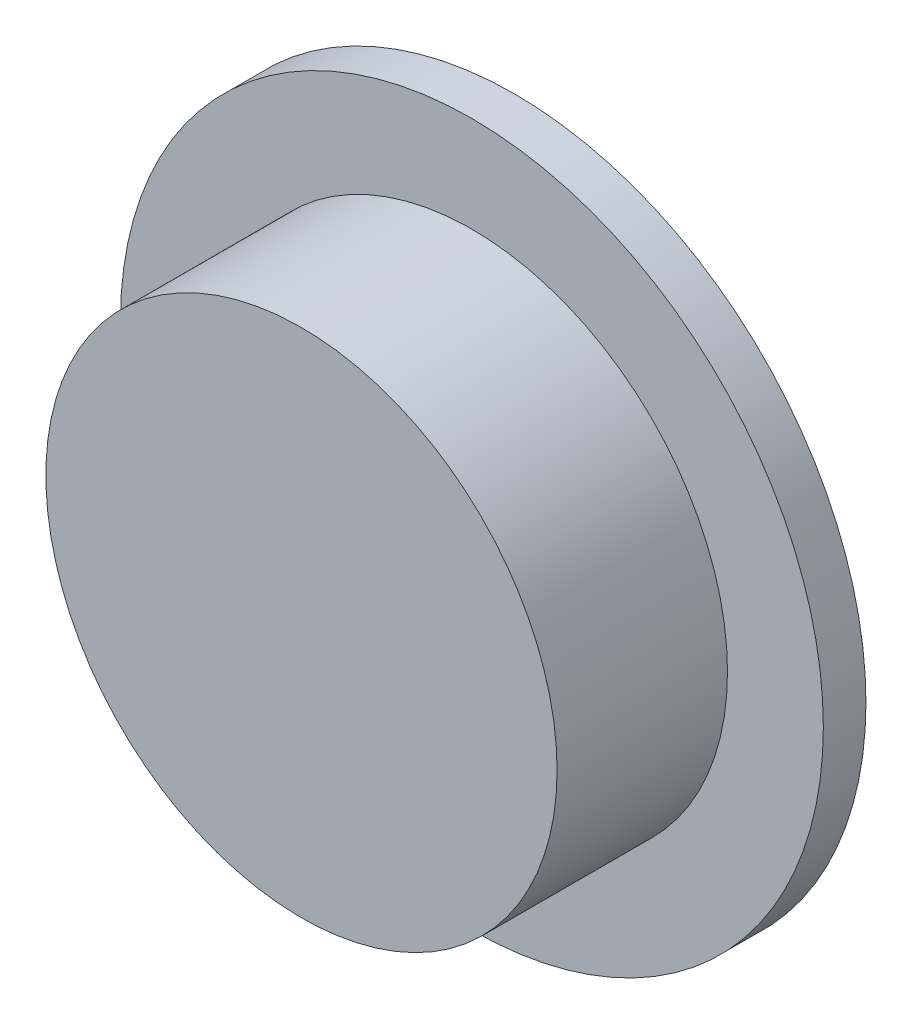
ISO-10303-21;
HEADER;
FILE_DESCRIPTION(('STEP AP214'),'2;1');
FILE_NAME('part.step','',(''),(''),'','','');
FILE_SCHEMA(('AUTOMOTIVE_DESIGN { 1 0 10303 214 1 1 1 1 }'));
ENDSEC;
DATA;
#1=APPLICATION_CONTEXT('core data for automotive mechanical design processes');
#2=APPLICATION_PROTOCOL_DEFINITION('international standard','automotive_design',2000,#1);
#3=PRODUCT_CONTEXT('',#1,'mechanical');
#4=PRODUCT('Part','Part','',(#3));
#5=PRODUCT_RELATED_PRODUCT_CATEGORY('part','',(#4));
#6=PRODUCT_DEFINITION_FORMATION('','',#4);
#7=PRODUCT_DEFINITION_CONTEXT('part definition',#1,'design');
#8=PRODUCT_DEFINITION('design','',#6,#7);
#9=PRODUCT_DEFINITION_SHAPE('','',#8);
#10=(LENGTH_UNIT() NAMED_UNIT(*) SI_UNIT(.MILLI.,.METRE.));
#11=(NAMED_UNIT(*) PLANE_ANGLE_UNIT() SI_UNIT($,.RADIAN.));
#12=(NAMED_UNIT(*) SI_UNIT($,.STERADIAN.) SOLID_ANGLE_UNIT());
#13=UNCERTAINTY_MEASURE_WITH_UNIT(LENGTH_MEASURE(1.E-05),#10,'distance_accuracy_value','');
#14=(GEOMETRIC_REPRESENTATION_CONTEXT(3) GLOBAL_UNCERTAINTY_ASSIGNED_CONTEXT((#13)) GLOBAL_UNIT_ASSIGNED_CONTEXT((#10,
#11,#12)) REPRESENTATION_CONTEXT('',''));
#15=CARTESIAN_POINT('',(0.,0.,0.));
#16=DIRECTION('',(0.,0.,1.));
#17=DIRECTION('',(1.,0.,0.));
#18=AXIS2_PLACEMENT_3D('',#15,#16,#17);
#19=CARTESIAN_POINT('',(0.,0.,2.));
#20=DIRECTION('',(0.,0.,-1.));
#21=DIRECTION('',(-1.,0.,0.));
#22=AXIS2_PLACEMENT_3D('',#19,#20,#21);
#23=CYLINDRICAL_SURFACE('',#22,16.5);
#24=CARTESIAN_POINT('',(0.,0.,2.));
#25=DIRECTION('',(0.,0.,1.));
#26=DIRECTION('',(1.,0.,0.));
#27=AXIS2_PLACEMENT_3D('',#24,#25,#26);
#28=CIRCLE('',#27,16.5);
#29=CARTESIAN_POINT('',(16.5,0.,2.));
#30=VERTEX_POINT('',#29);
#31=EDGE_CURVE('E42',#30,#30,#28,.T.);
#32=ORIENTED_EDGE('',*,*,#31,.F.);
#33=EDGE_LOOP('',(#32));
#34=FACE_BOUND('',#33,.T.);
#35=CARTESIAN_POINT('',(0.,0.,0.));
#36=DIRECTION('',(0.,0.,1.));
#37=DIRECTION('',(1.,0.,0.));
#38=AXIS2_PLACEMENT_3D('',#35,#36,#37);
#39=CIRCLE('',#38,16.5);
#40=CARTESIAN_POINT('',(16.5,0.,0.));
#41=VERTEX_POINT('',#40);
#42=EDGE_CURVE('E47',#41,#41,#39,.T.);
#43=ORIENTED_EDGE('',*,*,#42,.T.);
#44=EDGE_LOOP('',(#43));
#45=FACE_BOUND('',#44,.T.);
#46=ADVANCED_FACE('F35',(#34,#45),#23,.T.);
#47=CARTESIAN_POINT('',(0.,0.,2.));
#48=DIRECTION('',(0.,0.,1.));
#49=DIRECTION('',(1.,0.,0.));
#50=AXIS2_PLACEMENT_3D('',#47,#48,#49);
#51=PLANE('',#50);
#52=CARTESIAN_POINT('',(0.,0.,2.));
#53=DIRECTION('',(0.,0.,1.));
#54=DIRECTION('',(1.,0.,0.));
#55=AXIS2_PLACEMENT_3D('',#52,#53,#54);
#56=CIRCLE('',#55,12.);
#57=CARTESIAN_POINT('',(12.,0.,2.));
#58=VERTEX_POINT('',#57);
#59=EDGE_CURVE('E10',#58,#58,#56,.T.);
#60=ORIENTED_EDGE('',*,*,#59,.F.);
#61=EDGE_LOOP('',(#60));
#62=FACE_BOUND('',#61,.T.);
#63=ORIENTED_EDGE('',*,*,#31,.T.);
#64=EDGE_LOOP('',(#63));
#65=FACE_BOUND('',#64,.T.);
#66=ADVANCED_FACE('F93',(#62,#65),#51,.T.);
#67=CARTESIAN_POINT('',(0.,0.,0.));
#68=DIRECTION('',(0.,0.,1.));
#69=DIRECTION('',(1.,0.,0.));
#70=AXIS2_PLACEMENT_3D('',#67,#68,#69);
#71=PLANE('',#70);
#72=CARTESIAN_POINT('',(0.,0.,0.));
#73=DIRECTION('',(0.,0.,1.));
#74=DIRECTION('',(1.,0.,0.));
#75=AXIS2_PLACEMENT_3D('',#72,#73,#74);
#76=CIRCLE('',#75,12.);
#77=CARTESIAN_POINT('',(12.,0.,0.));
#78=VERTEX_POINT('',#77);
#79=EDGE_CURVE('E38',#78,#78,#76,.T.);
#80=ORIENTED_EDGE('',*,*,#79,.T.);
#81=EDGE_LOOP('',(#80));
#82=FACE_BOUND('',#81,.T.);
#83=ORIENTED_EDGE('',*,*,#42,.F.);
#84=EDGE_LOOP('',(#83));
#85=FACE_BOUND('',#84,.T.);
#86=ADVANCED_FACE('F85',(#82,#85),#71,.F.);
#87=CARTESIAN_POINT('',(0.,0.,-2.));
#88=DIRECTION('',(0.,0.,1.));
#89=DIRECTION('',(1.,0.,0.));
#90=AXIS2_PLACEMENT_3D('',#87,#88,#89);
#91=PLANE('',#90);
#92=CARTESIAN_POINT('',(0.,0.,-2.));
#93=DIRECTION('',(0.,0.,-1.));
#94=DIRECTION('',(-1.,0.,0.));
#95=AXIS2_PLACEMENT_3D('',#92,#93,#94);
#96=CIRCLE('',#95,8.00000000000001);
#97=CARTESIAN_POINT('',(-8.00000000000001,0.,-2.));
#98=VERTEX_POINT('',#97);
#99=EDGE_CURVE('E75',#98,#98,#96,.T.);
#100=ORIENTED_EDGE('',*,*,#99,.F.);
#101=EDGE_LOOP('',(#100));
#102=FACE_BOUND('',#101,.T.);
#103=CARTESIAN_POINT('',(0.,0.,-2.));
#104=DIRECTION('',(0.,0.,1.));
#105=DIRECTION('',(1.,0.,0.));
#106=AXIS2_PLACEMENT_3D('',#103,#104,#105);
#107=CIRCLE('',#106,12.);
#108=CARTESIAN_POINT('',(12.,0.,-2.));
#109=VERTEX_POINT('',#108);
#110=EDGE_CURVE('E50',#109,#109,#107,.T.);
#111=ORIENTED_EDGE('',*,*,#110,.F.);
#112=EDGE_LOOP('',(#111));
#113=FACE_BOUND('',#112,.T.);
#114=ADVANCED_FACE('F81',(#102,#113),#91,.F.);
#115=CARTESIAN_POINT('',(0.,0.,-2.));
#116=DIRECTION('',(0.,0.,1.));
#117=DIRECTION('',(1.,0.,0.));
#118=AXIS2_PLACEMENT_3D('',#115,#116,#117);
#119=CYLINDRICAL_SURFACE('',#118,12.);
#120=ORIENTED_EDGE('',*,*,#110,.T.);
#121=EDGE_LOOP('',(#120));
#122=FACE_BOUND('',#121,.T.);
#123=ORIENTED_EDGE('',*,*,#79,.F.);
#124=EDGE_LOOP('',(#123));
#125=FACE_BOUND('',#124,.T.);
#126=ADVANCED_FACE('F84',(#122,#125),#119,.T.);
#127=ORIENTED_EDGE('',*,*,#59,.T.);
#128=EDGE_LOOP('',(#127));
#129=FACE_BOUND('',#128,.T.);
#130=CARTESIAN_POINT('',(0.,0.,10.));
#131=DIRECTION('',(0.,0.,1.));
#132=DIRECTION('',(1.,0.,0.));
#133=AXIS2_PLACEMENT_3D('',#130,#131,#132);
#134=CIRCLE('',#133,12.);
#135=CARTESIAN_POINT('',(12.,0.,10.));
#136=VERTEX_POINT('',#135);
#137=EDGE_CURVE('E59',#136,#136,#134,.T.);
#138=ORIENTED_EDGE('',*,*,#137,.F.);
#139=EDGE_LOOP('',(#138));
#140=FACE_BOUND('',#139,.T.);
#141=ADVANCED_FACE('F91',(#129,#140),#119,.T.);
#142=CARTESIAN_POINT('',(0.,0.,10.));
#143=DIRECTION('',(0.,0.,1.));
#144=DIRECTION('',(1.,0.,0.));
#145=AXIS2_PLACEMENT_3D('',#142,#143,#144);
#146=PLANE('',#145);
#147=ORIENTED_EDGE('',*,*,#137,.T.);
#148=EDGE_LOOP('',(#147));
#149=FACE_BOUND('',#148,.T.);
#150=ADVANCED_FACE('F107',(#149),#146,.T.);
#151=CARTESIAN_POINT('',(0.,0.,4.99988571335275));
#152=DIRECTION('',(0.,0.,1.));
#153=DIRECTION('',(1.,0.,0.));
#154=AXIS2_PLACEMENT_3D('',#151,#152,#153);
#155=PLANE('',#154);
#156=CARTESIAN_POINT('',(0.,0.,4.99988571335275));
#157=DIRECTION('',(0.,0.,-1.));
#158=DIRECTION('',(-1.,0.,0.));
#159=AXIS2_PLACEMENT_3D('',#156,#157,#158);
#160=CIRCLE('',#159,6.00000000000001);
#161=CARTESIAN_POINT('',(-6.00000000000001,0.,4.99988571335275));
#162=VERTEX_POINT('',#161);
#163=EDGE_CURVE('E63',#162,#162,#160,.T.);
#164=ORIENTED_EDGE('',*,*,#163,.T.);
#165=EDGE_LOOP('',(#164));
#166=FACE_BOUND('',#165,.T.);
#167=ADVANCED_FACE('F111',(#166),#155,.F.);
#168=CARTESIAN_POINT('',(0.,0.,-2.));
#169=DIRECTION('',(0.,0.,-1.));
#170=DIRECTION('',(-1.,0.,0.));
#171=AXIS2_PLACEMENT_3D('',#168,#169,#170);
#172=CYLINDRICAL_SURFACE('',#171,6.00000000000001);
#173=ORIENTED_EDGE('',*,*,#163,.F.);
#174=EDGE_LOOP('',(#173));
#175=FACE_BOUND('',#174,.T.);
#176=CARTESIAN_POINT('',(0.,0.,-1.));
#177=DIRECTION('',(0.,0.,-1.));
#178=DIRECTION('',(-1.,0.,0.));
#179=AXIS2_PLACEMENT_3D('',#176,#177,#178);
#180=CIRCLE('',#179,6.00000000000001);
#181=CARTESIAN_POINT('',(-6.00000000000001,0.,-1.));
#182=VERTEX_POINT('',#181);
#183=EDGE_CURVE('E67',#182,#182,#180,.T.);
#184=ORIENTED_EDGE('',*,*,#183,.T.);
#185=EDGE_LOOP('',(#184));
#186=FACE_BOUND('',#185,.T.);
#187=ADVANCED_FACE('F116',(#175,#186),#172,.F.);
#188=CARTESIAN_POINT('',(6.00000000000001,0.,-1.));
#189=DIRECTION('',(0.,0.,1.));
#190=DIRECTION('',(1.,0.,0.));
#191=AXIS2_PLACEMENT_3D('',#188,#189,#190);
#192=PLANE('',#191);
#193=ORIENTED_EDGE('',*,*,#183,.F.);
#194=EDGE_LOOP('',(#193));
#195=FACE_BOUND('',#194,.T.);
#196=CARTESIAN_POINT('',(0.,0.,-1.));
#197=DIRECTION('',(0.,0.,-1.));
#198=DIRECTION('',(-1.,0.,0.));
#199=AXIS2_PLACEMENT_3D('',#196,#197,#198);
#200=CIRCLE('',#199,8.00000000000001);
#201=CARTESIAN_POINT('',(-8.00000000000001,0.,-1.));
#202=VERTEX_POINT('',#201);
#203=EDGE_CURVE('E72',#202,#202,#200,.T.);
#204=ORIENTED_EDGE('',*,*,#203,.T.);
#205=EDGE_LOOP('',(#204));
#206=FACE_BOUND('',#205,.T.);
#207=ADVANCED_FACE('F122',(#195,#206),#192,.F.);
#208=CARTESIAN_POINT('',(0.,0.,-2.));
#209=DIRECTION('',(0.,0.,-1.));
#210=DIRECTION('',(-1.,0.,0.));
#211=AXIS2_PLACEMENT_3D('',#208,#209,#210);
#212=CYLINDRICAL_SURFACE('',#211,8.00000000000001);
#213=ORIENTED_EDGE('',*,*,#203,.F.);
#214=EDGE_LOOP('',(#213));
#215=FACE_BOUND('',#214,.T.);
#216=ORIENTED_EDGE('',*,*,#99,.T.);
#217=EDGE_LOOP('',(#216));
#218=FACE_BOUND('',#217,.T.);
#219=ADVANCED_FACE('F79',(#215,#218),#212,.F.);
#220=CLOSED_SHELL('',(#46,#66,#86,#114,#126,#141,#150,#167,#187,#207,#219));
#221=MANIFOLD_SOLID_BREP('B2',#220);
#222=ADVANCED_BREP_SHAPE_REPRESENTATION('',(#18,#221),#14);
#223=SHAPE_DEFINITION_REPRESENTATION(#9,#222);
ENDSEC;
END-ISO-10303-21;
